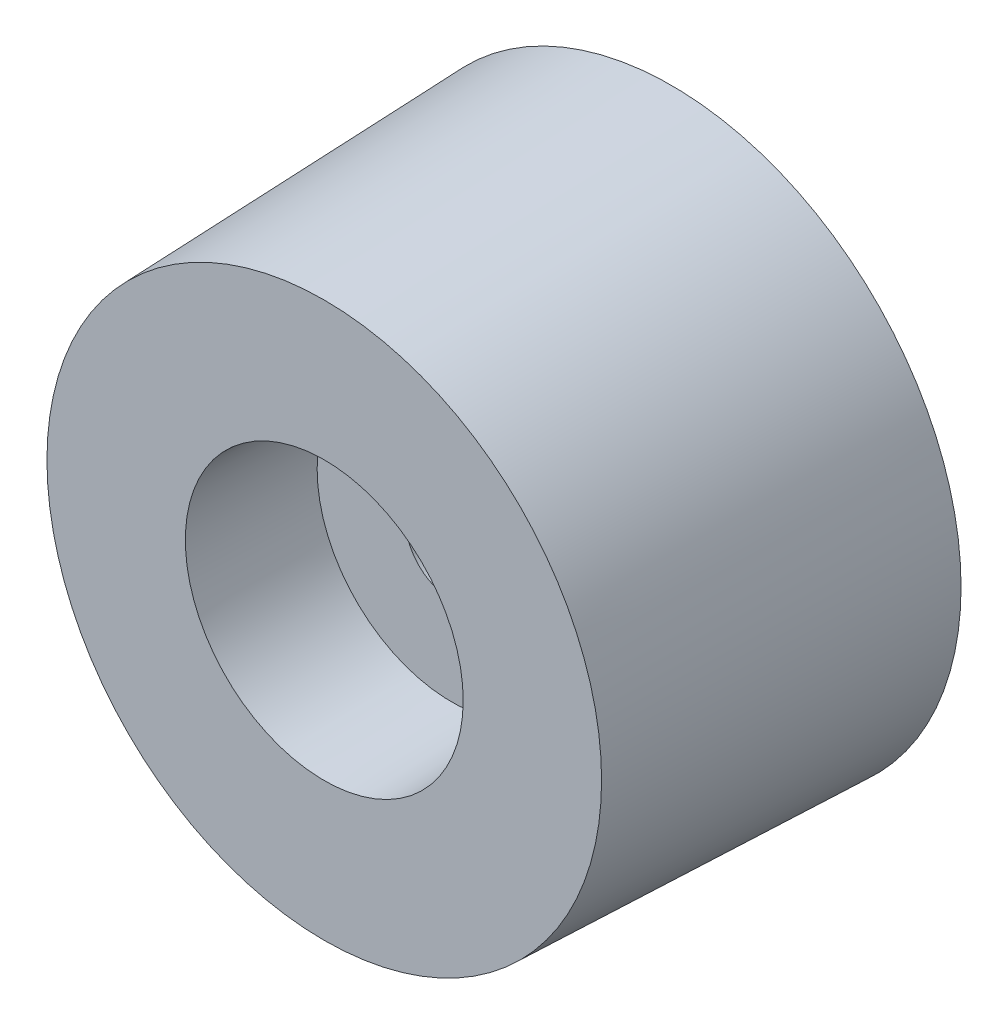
ISO-10303-21;
HEADER;
FILE_DESCRIPTION(('STEP AP214'),'2;1');
FILE_NAME('part.step','',(''),(''),'','','');
FILE_SCHEMA(('AUTOMOTIVE_DESIGN { 1 0 10303 214 1 1 1 1 }'));
ENDSEC;
DATA;
#1=APPLICATION_CONTEXT('core data for automotive mechanical design processes');
#2=APPLICATION_PROTOCOL_DEFINITION('international standard','automotive_design',2000,#1);
#3=PRODUCT_CONTEXT('',#1,'mechanical');
#4=PRODUCT('Part','Part','',(#3));
#5=PRODUCT_RELATED_PRODUCT_CATEGORY('part','',(#4));
#6=PRODUCT_DEFINITION_FORMATION('','',#4);
#7=PRODUCT_DEFINITION_CONTEXT('part definition',#1,'design');
#8=PRODUCT_DEFINITION('design','',#6,#7);
#9=PRODUCT_DEFINITION_SHAPE('','',#8);
#10=(LENGTH_UNIT() NAMED_UNIT(*) SI_UNIT(.MILLI.,.METRE.));
#11=(NAMED_UNIT(*) PLANE_ANGLE_UNIT() SI_UNIT($,.RADIAN.));
#12=(NAMED_UNIT(*) SI_UNIT($,.STERADIAN.) SOLID_ANGLE_UNIT());
#13=UNCERTAINTY_MEASURE_WITH_UNIT(LENGTH_MEASURE(1.E-05),#10,'distance_accuracy_value','');
#14=(GEOMETRIC_REPRESENTATION_CONTEXT(3) GLOBAL_UNCERTAINTY_ASSIGNED_CONTEXT((#13)) GLOBAL_UNIT_ASSIGNED_CONTEXT((#10,
#11,#12)) REPRESENTATION_CONTEXT('',''));
#15=CARTESIAN_POINT('',(0.,0.,0.));
#16=DIRECTION('',(0.,0.,1.));
#17=DIRECTION('',(1.,0.,0.));
#18=AXIS2_PLACEMENT_3D('',#15,#16,#17);
#19=CARTESIAN_POINT('',(5.55111512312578E-13,-5.58580959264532E-13,0.));
#20=DIRECTION('',(0.,0.,-0.999999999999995));
#21=DIRECTION('',(-1.,0.,0.));
#22=AXIS2_PLACEMENT_3D('',#19,#20,#21);
#23=CONICAL_SURFACE('',#22,12.5,0.0349065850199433);
#24=CARTESIAN_POINT('',(5.55111512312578E-13,-5.58580959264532E-13,15.0000000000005));
#25=DIRECTION('',(0.,0.,0.999999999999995));
#26=DIRECTION('',(1.,0.,0.));
#27=AXIS2_PLACEMENT_3D('',#24,#25,#26);
#28=CIRCLE('',#27,11.9761884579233);
#29=CARTESIAN_POINT('',(-11.9761884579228,-5.58307971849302E-13,15.0000000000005));
#30=VERTEX_POINT('',#29);
#31=EDGE_CURVE('E10',#30,#30,#28,.T.);
#32=CARTESIAN_POINT('',(5.55111512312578E-13,-5.58580959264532E-13,0.));
#33=DIRECTION('',(0.,0.,0.999999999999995));
#34=DIRECTION('',(1.,0.,0.));
#35=AXIS2_PLACEMENT_3D('',#32,#33,#34);
#36=CIRCLE('',#35,12.5);
#37=CARTESIAN_POINT('',(-12.4999999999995,-5.48866507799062E-13,0.));
#38=VERTEX_POINT('',#37);
#39=EDGE_CURVE('E42',#38,#38,#36,.T.);
#40=CARTESIAN_POINT('',(-11.9761884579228,-5.58307971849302E-13,15.0000000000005));
#41=CARTESIAN_POINT('',(-11.9816448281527,-5.58209623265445E-13,14.8437500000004));
#42=CARTESIAN_POINT('',(-11.9871011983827,-5.58111274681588E-13,14.6875000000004));
#43=CARTESIAN_POINT('',(-11.9980139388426,-5.57914577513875E-13,14.3750000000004));
#44=CARTESIAN_POINT('',(-12.0034703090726,-5.57816228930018E-13,14.2187500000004));
#45=CARTESIAN_POINT('',(-12.0143830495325,-5.57619531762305E-13,13.9062500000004));
#46=CARTESIAN_POINT('',(-12.0198394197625,-5.57521183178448E-13,13.7500000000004));
#47=CARTESIAN_POINT('',(-12.0307521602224,-5.57324486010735E-13,13.4375000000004));
#48=CARTESIAN_POINT('',(-12.0362085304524,-5.57226137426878E-13,13.2812500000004));
#49=CARTESIAN_POINT('',(-12.0471212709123,-5.57029440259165E-13,12.9687500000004));
#50=CARTESIAN_POINT('',(-12.0525776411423,-5.56931091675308E-13,12.8125000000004));
#51=CARTESIAN_POINT('',(-12.0634903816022,-5.56734394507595E-13,12.5000000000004));
#52=CARTESIAN_POINT('',(-12.0689467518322,-5.56636045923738E-13,12.3437500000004));
#53=CARTESIAN_POINT('',(-12.0798594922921,-5.56439348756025E-13,12.0312500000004));
#54=CARTESIAN_POINT('',(-12.0853158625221,-5.56341000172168E-13,11.8750000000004));
#55=CARTESIAN_POINT('',(-12.096228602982,-5.56144303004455E-13,11.5625000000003));
#56=CARTESIAN_POINT('',(-12.101684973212,-5.56045954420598E-13,11.4062500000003));
#57=CARTESIAN_POINT('',(-12.1125977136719,-5.55849257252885E-13,11.0937500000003));
#58=CARTESIAN_POINT('',(-12.1180540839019,-5.55750908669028E-13,10.9375000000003));
#59=CARTESIAN_POINT('',(-12.1289668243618,-5.55554211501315E-13,10.6250000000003));
#60=CARTESIAN_POINT('',(-12.1344231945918,-5.55455862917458E-13,10.4687500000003));
#61=CARTESIAN_POINT('',(-12.1453359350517,-5.55259165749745E-13,10.1562500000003));
#62=CARTESIAN_POINT('',(-12.1507923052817,-5.55160817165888E-13,10.0000000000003));
#63=CARTESIAN_POINT('',(-12.1617050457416,-5.54964119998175E-13,9.68750000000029));
#64=CARTESIAN_POINT('',(-12.1671614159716,-5.54865771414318E-13,9.53125000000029));
#65=CARTESIAN_POINT('',(-12.1780741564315,-5.54669074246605E-13,9.21875000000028));
#66=CARTESIAN_POINT('',(-12.1835305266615,-5.54570725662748E-13,9.06250000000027));
#67=CARTESIAN_POINT('',(-12.1944432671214,-5.54374028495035E-13,8.75000000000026));
#68=CARTESIAN_POINT('',(-12.1998996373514,-5.54275679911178E-13,8.59375000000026));
#69=CARTESIAN_POINT('',(-12.2108123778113,-5.54078982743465E-13,8.28125000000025));
#70=CARTESIAN_POINT('',(-12.2162687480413,-5.53980634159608E-13,8.12500000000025));
#71=CARTESIAN_POINT('',(-12.2271814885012,-5.53783936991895E-13,7.81250000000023));
#72=CARTESIAN_POINT('',(-12.2326378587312,-5.53685588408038E-13,7.65625000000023));
#73=CARTESIAN_POINT('',(-12.2435505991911,-5.53488891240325E-13,7.34375000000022));
#74=CARTESIAN_POINT('',(-12.2490069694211,-5.53390542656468E-13,7.18750000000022));
#75=CARTESIAN_POINT('',(-12.259919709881,-5.53193845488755E-13,6.87500000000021));
#76=CARTESIAN_POINT('',(-12.265376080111,-5.53095496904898E-13,6.7187500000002));
#77=CARTESIAN_POINT('',(-12.2762888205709,-5.52898799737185E-13,6.40625000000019));
#78=CARTESIAN_POINT('',(-12.2817451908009,-5.52800451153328E-13,6.25000000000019));
#79=CARTESIAN_POINT('',(-12.2926579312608,-5.52603753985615E-13,5.93750000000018));
#80=CARTESIAN_POINT('',(-12.2981143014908,-5.52505405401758E-13,5.78125000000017));
#81=CARTESIAN_POINT('',(-12.3090270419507,-5.52308708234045E-13,5.46875000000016));
#82=CARTESIAN_POINT('',(-12.3144834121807,-5.52210359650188E-13,5.31250000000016));
#83=CARTESIAN_POINT('',(-12.3253961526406,-5.52013662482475E-13,5.00000000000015));
#84=CARTESIAN_POINT('',(-12.3308525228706,-5.51915313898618E-13,4.84375000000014));
#85=CARTESIAN_POINT('',(-12.3417652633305,-5.51718616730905E-13,4.53125000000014));
#86=CARTESIAN_POINT('',(-12.3472216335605,-5.51620268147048E-13,4.37500000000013));
#87=CARTESIAN_POINT('',(-12.3581343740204,-5.51423570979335E-13,4.06250000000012));
#88=CARTESIAN_POINT('',(-12.3635907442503,-5.51325222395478E-13,3.90625000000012));
#89=CARTESIAN_POINT('',(-12.3745034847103,-5.51128525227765E-13,3.59375000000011));
#90=CARTESIAN_POINT('',(-12.3799598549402,-5.51030176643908E-13,3.4375000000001));
#91=CARTESIAN_POINT('',(-12.3908725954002,-5.50833479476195E-13,3.12500000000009));
#92=CARTESIAN_POINT('',(-12.3963289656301,-5.50735130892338E-13,2.96875000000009));
#93=CARTESIAN_POINT('',(-12.4072417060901,-5.50538433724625E-13,2.65625000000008));
#94=CARTESIAN_POINT('',(-12.41269807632,-5.50440085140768E-13,2.50000000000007));
#95=CARTESIAN_POINT('',(-12.42361081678,-5.50243387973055E-13,2.18750000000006));
#96=CARTESIAN_POINT('',(-12.4290671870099,-5.50145039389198E-13,2.03125000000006));
#97=CARTESIAN_POINT('',(-12.4399799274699,-5.49948342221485E-13,1.71875000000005));
#98=CARTESIAN_POINT('',(-12.4454362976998,-5.49849993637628E-13,1.56250000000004));
#99=CARTESIAN_POINT('',(-12.4563490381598,-5.49653296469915E-13,1.25000000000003));
#100=CARTESIAN_POINT('',(-12.4618054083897,-5.49554947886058E-13,1.09375000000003));
#101=CARTESIAN_POINT('',(-12.4727181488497,-5.49358250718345E-13,0.781250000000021));
#102=CARTESIAN_POINT('',(-12.4781745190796,-5.49259902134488E-13,0.625000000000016));
#103=CARTESIAN_POINT('',(-12.4890872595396,-5.49063204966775E-13,0.312500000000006));
#104=CARTESIAN_POINT('',(-12.4945436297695,-5.48964856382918E-13,0.156250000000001));
#105=CARTESIAN_POINT('',(-12.4999999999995,-5.48866507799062E-13,0.));
#106=B_SPLINE_CURVE_WITH_KNOTS('',3,(#40,#41,#42,#43,#44,#45,#46,#47,#48,#49,#50,#51,#52,#53,
#54,#55,#56,#57,#58,#59,#60,#61,#62,#63,#64,#65,#66,#67,#68,#69,#70,#71,#72,#73,#74,#75,#76,#77,
#78,#79,#80,#81,#82,#83,#84,#85,#86,#87,#88,#89,#90,#91,#92,#93,#94,#95,#96,#97,#98,#99,#100,
#101,#102,#103,#104,#105),.UNSPECIFIED.,.F.,.F.,(4,2,2,2,2,2,2,2,2,2,2,2,2,2,2,2,2,2,2,2,2,2,2,
2,2,2,2,2,2,2,2,2,4),(0.,0.46903572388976,0.938071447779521,1.40710717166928,1.87614289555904,
2.3451786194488,2.81421434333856,3.28325006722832,3.75228579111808,4.22132151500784,
4.6903572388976,5.15939296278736,5.62842868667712,6.09746441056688,6.56650013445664,
7.0355358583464,7.50457158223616,7.97360730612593,8.44264303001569,8.91167875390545,
9.38071447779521,9.84975020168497,10.3187859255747,10.7878216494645,11.2568573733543,
11.725893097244,12.1949288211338,12.6639645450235,13.1330002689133,13.6020359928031,
14.0710717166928,14.5401074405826,15.0091431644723),.UNSPECIFIED.);
#107=EDGE_CURVE('BSEAM36',#30,#38,#106,.T.);
#108=ORIENTED_EDGE('',*,*,#31,.F.);
#109=ORIENTED_EDGE('',*,*,#39,.T.);
#110=ORIENTED_EDGE('',*,*,#107,.T.);
#111=ORIENTED_EDGE('',*,*,#107,.F.);
#112=EDGE_LOOP('',(#108,#110,#109,#111));
#113=FACE_BOUND('',#112,.T.);
#114=ADVANCED_FACE('F36',(#113),#23,.T.);
#115=CARTESIAN_POINT('',(5.55111512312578E-13,-5.58580959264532E-13,15.0000000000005));
#116=DIRECTION('',(0.,0.,0.999999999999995));
#117=DIRECTION('',(1.,0.,0.));
#118=AXIS2_PLACEMENT_3D('',#115,#116,#117);
#119=PLANE('',#118);
#120=CARTESIAN_POINT('',(5.55111512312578E-13,-5.58580959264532E-13,15.0000000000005));
#121=DIRECTION('',(0.,0.,0.999999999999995));
#122=DIRECTION('',(1.,0.,0.));
#123=AXIS2_PLACEMENT_3D('',#120,#121,#122);
#124=CIRCLE('',#123,6.);
#125=CARTESIAN_POINT('',(6.00000000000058,-5.63243895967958E-13,15.0000000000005));
#126=VERTEX_POINT('',#125);
#127=EDGE_CURVE('E50',#126,#126,#124,.T.);
#128=ORIENTED_EDGE('',*,*,#127,.F.);
#129=EDGE_LOOP('',(#128));
#130=FACE_BOUND('',#129,.T.);
#131=ORIENTED_EDGE('',*,*,#31,.T.);
#132=EDGE_LOOP('',(#131));
#133=FACE_BOUND('',#132,.T.);
#134=ADVANCED_FACE('F77',(#130,#133),#119,.T.);
#135=CARTESIAN_POINT('',(5.55111512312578E-13,-5.58580959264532E-13,0.));
#136=DIRECTION('',(0.,0.,0.999999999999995));
#137=DIRECTION('',(1.,0.,0.));
#138=AXIS2_PLACEMENT_3D('',#135,#136,#137);
#139=PLANE('',#138);
#140=CARTESIAN_POINT('',(5.55111512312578E-13,-5.58580959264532E-13,0.));
#141=DIRECTION('',(0.,0.,0.999999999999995));
#142=DIRECTION('',(1.,0.,0.));
#143=AXIS2_PLACEMENT_3D('',#140,#141,#142);
#144=CIRCLE('',#143,2.);
#145=CARTESIAN_POINT('',(2.00000000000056,-5.60135271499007E-13,0.));
#146=VERTEX_POINT('',#145);
#147=EDGE_CURVE('E55',#146,#146,#144,.T.);
#148=ORIENTED_EDGE('',*,*,#147,.T.);
#149=EDGE_LOOP('',(#148));
#150=FACE_BOUND('',#149,.T.);
#151=ORIENTED_EDGE('',*,*,#39,.F.);
#152=EDGE_LOOP('',(#151));
#153=FACE_BOUND('',#152,.T.);
#154=ADVANCED_FACE('F69',(#150,#153),#139,.F.);
#155=CARTESIAN_POINT('',(5.55111512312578E-13,-5.58580959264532E-13,15.0000000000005));
#156=DIRECTION('',(0.,0.,0.999999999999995));
#157=DIRECTION('',(1.,0.,0.));
#158=AXIS2_PLACEMENT_3D('',#155,#156,#157);
#159=CONICAL_SURFACE('',#158,6.,0.0349065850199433);
#160=CARTESIAN_POINT('',(6.66133814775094E-13,0.,9.50000000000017));
#161=DIRECTION('',(0.,0.,0.999999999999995));
#162=DIRECTION('',(1.,0.,0.));
#163=AXIS2_PLACEMENT_3D('',#160,#161,#162);
#164=CIRCLE('',#163,5.80793576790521);
#165=CARTESIAN_POINT('',(5.80793576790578,-5.59782025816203E-13,9.50000000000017));
#166=VERTEX_POINT('',#165);
#167=EDGE_CURVE('E46',#166,#166,#164,.T.);
#168=CARTESIAN_POINT('',(5.80793576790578,-5.59782025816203E-13,9.50000000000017));
#169=CARTESIAN_POINT('',(5.8099364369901,-5.59818086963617E-13,9.55729166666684));
#170=CARTESIAN_POINT('',(5.81193710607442,-5.59854148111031E-13,9.61458333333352));
#171=CARTESIAN_POINT('',(5.81593844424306,-5.59926270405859E-13,9.72916666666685));
#172=CARTESIAN_POINT('',(5.81793911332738,-5.59962331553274E-13,9.78645833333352));
#173=CARTESIAN_POINT('',(5.82194045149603,-5.60034453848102E-13,9.90104166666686));
#174=CARTESIAN_POINT('',(5.82394112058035,-5.60070514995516E-13,9.95833333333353));
#175=CARTESIAN_POINT('',(5.82794245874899,-5.60142637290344E-13,10.0729166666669));
#176=CARTESIAN_POINT('',(5.82994312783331,-5.60178698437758E-13,10.1302083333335));
#177=CARTESIAN_POINT('',(5.83394446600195,-5.60250820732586E-13,10.2447916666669));
#178=CARTESIAN_POINT('',(5.83594513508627,-5.6028688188E-13,10.3020833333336));
#179=CARTESIAN_POINT('',(5.83994647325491,-5.60359004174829E-13,10.4166666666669));
#180=CARTESIAN_POINT('',(5.84194714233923,-5.60395065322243E-13,10.4739583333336));
#181=CARTESIAN_POINT('',(5.84594848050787,-5.60467187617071E-13,10.5885416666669));
#182=CARTESIAN_POINT('',(5.8479491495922,-5.60503248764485E-13,10.6458333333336));
#183=CARTESIAN_POINT('',(5.85195048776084,-5.60575371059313E-13,10.7604166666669));
#184=CARTESIAN_POINT('',(5.85395115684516,-5.60611432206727E-13,10.8177083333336));
#185=CARTESIAN_POINT('',(5.8579524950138,-5.60683554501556E-13,10.9322916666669));
#186=CARTESIAN_POINT('',(5.85995316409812,-5.6071961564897E-13,10.9895833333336));
#187=CARTESIAN_POINT('',(5.86395450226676,-5.60791737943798E-13,11.1041666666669));
#188=CARTESIAN_POINT('',(5.86595517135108,-5.60827799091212E-13,11.1614583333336));
#189=CARTESIAN_POINT('',(5.86995650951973,-5.6089992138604E-13,11.2760416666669));
#190=CARTESIAN_POINT('',(5.87195717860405,-5.60935982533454E-13,11.3333333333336));
#191=CARTESIAN_POINT('',(5.87595851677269,-5.61008104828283E-13,11.4479166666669));
#192=CARTESIAN_POINT('',(5.87795918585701,-5.61044165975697E-13,11.5052083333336));
#193=CARTESIAN_POINT('',(5.88196052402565,-5.61116288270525E-13,11.619791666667));
#194=CARTESIAN_POINT('',(5.88396119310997,-5.61152349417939E-13,11.6770833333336));
#195=CARTESIAN_POINT('',(5.88796253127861,-5.61224471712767E-13,11.791666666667));
#196=CARTESIAN_POINT('',(5.88996320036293,-5.61260532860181E-13,11.8489583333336));
#197=CARTESIAN_POINT('',(5.89396453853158,-5.6133265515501E-13,11.963541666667));
#198=CARTESIAN_POINT('',(5.8959652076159,-5.61368716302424E-13,12.0208333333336));
#199=CARTESIAN_POINT('',(5.89996654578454,-5.61440838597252E-13,12.135416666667));
#200=CARTESIAN_POINT('',(5.90196721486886,-5.61476899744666E-13,12.1927083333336));
#201=CARTESIAN_POINT('',(5.9059685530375,-5.61549022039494E-13,12.307291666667));
#202=CARTESIAN_POINT('',(5.90796922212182,-5.61585083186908E-13,12.3645833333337));
#203=CARTESIAN_POINT('',(5.91197056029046,-5.61657205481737E-13,12.479166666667));
#204=CARTESIAN_POINT('',(5.91397122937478,-5.61693266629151E-13,12.5364583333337));
#205=CARTESIAN_POINT('',(5.91797256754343,-5.61765388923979E-13,12.651041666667));
#206=CARTESIAN_POINT('',(5.91997323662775,-5.61801450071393E-13,12.7083333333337));
#207=CARTESIAN_POINT('',(5.92397457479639,-5.61873572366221E-13,12.822916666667));
#208=CARTESIAN_POINT('',(5.92597524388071,-5.61909633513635E-13,12.8802083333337));
#209=CARTESIAN_POINT('',(5.92997658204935,-5.61981755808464E-13,12.994791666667));
#210=CARTESIAN_POINT('',(5.93197725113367,-5.62017816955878E-13,13.0520833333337));
#211=CARTESIAN_POINT('',(5.93597858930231,-5.62089939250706E-13,13.166666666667));
#212=CARTESIAN_POINT('',(5.93797925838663,-5.6212600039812E-13,13.2239583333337));
#213=CARTESIAN_POINT('',(5.94198059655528,-5.62198122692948E-13,13.338541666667));
#214=CARTESIAN_POINT('',(5.9439812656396,-5.62234183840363E-13,13.3958333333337));
#215=CARTESIAN_POINT('',(5.94798260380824,-5.62306306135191E-13,13.510416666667));
#216=CARTESIAN_POINT('',(5.94998327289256,-5.62342367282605E-13,13.5677083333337));
#217=CARTESIAN_POINT('',(5.9539846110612,-5.62414489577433E-13,13.6822916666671));
#218=CARTESIAN_POINT('',(5.95598528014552,-5.62450550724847E-13,13.7395833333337));
#219=CARTESIAN_POINT('',(5.95998661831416,-5.62522673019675E-13,13.8541666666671));
#220=CARTESIAN_POINT('',(5.96198728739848,-5.62558734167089E-13,13.9114583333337));
#221=CARTESIAN_POINT('',(5.96598862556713,-5.62630856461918E-13,14.0260416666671));
#222=CARTESIAN_POINT('',(5.96798929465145,-5.62666917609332E-13,14.0833333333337));
#223=CARTESIAN_POINT('',(5.97199063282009,-5.6273903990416E-13,14.1979166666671));
#224=CARTESIAN_POINT('',(5.97399130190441,-5.62775101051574E-13,14.2552083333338));
#225=CARTESIAN_POINT('',(5.97799264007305,-5.62847223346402E-13,14.3697916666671));
#226=CARTESIAN_POINT('',(5.97999330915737,-5.62883284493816E-13,14.4270833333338));
#227=CARTESIAN_POINT('',(5.98399464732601,-5.62955406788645E-13,14.5416666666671));
#228=CARTESIAN_POINT('',(5.98599531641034,-5.62991467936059E-13,14.5989583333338));
#229=CARTESIAN_POINT('',(5.98999665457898,-5.63063590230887E-13,14.7135416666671));
#230=CARTESIAN_POINT('',(5.9919973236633,-5.63099651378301E-13,14.7708333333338));
#231=CARTESIAN_POINT('',(5.99599866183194,-5.63171773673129E-13,14.8854166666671));
#232=CARTESIAN_POINT('',(5.99799933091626,-5.63207834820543E-13,14.9427083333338));
#233=CARTESIAN_POINT('',(6.00000000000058,-5.63243895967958E-13,15.0000000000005));
#234=B_SPLINE_CURVE_WITH_KNOTS('',3,(#168,#169,#170,#171,#172,#173,#174,#175,#176,#177,#178,
#179,#180,#181,#182,#183,#184,#185,#186,#187,#188,#189,#190,#191,#192,#193,#194,#195,#196,#197,
#198,#199,#200,#201,#202,#203,#204,#205,#206,#207,#208,#209,#210,#211,#212,#213,#214,#215,#216,
#217,#218,#219,#220,#221,#222,#223,#224,#225,#226,#227,#228,#229,#230,#231,#232,#233),
.UNSPECIFIED.,.F.,.F.,(4,2,2,2,2,2,2,2,2,2,2,2,2,2,2,2,2,2,2,2,2,2,2,2,2,2,2,2,2,2,2,2,4),(0.,
0.171979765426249,0.343959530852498,0.515939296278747,0.687919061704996,0.859898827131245,
1.03187859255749,1.20385835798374,1.37583812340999,1.54781788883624,1.71979765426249,
1.89177741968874,2.06375718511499,2.23573695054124,2.40771671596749,2.57969648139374,
2.75167624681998,2.92365601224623,3.09563577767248,3.26761554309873,3.43959530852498,
3.61157507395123,3.78355483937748,3.95553460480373,4.12751437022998,4.29949413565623,
4.47147390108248,4.64345366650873,4.81543343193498,4.98741319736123,5.15939296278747,
5.33137272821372,5.50335249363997),.UNSPECIFIED.);
#235=EDGE_CURVE('BSEAM67',#166,#126,#234,.T.);
#236=ORIENTED_EDGE('',*,*,#167,.F.);
#237=ORIENTED_EDGE('',*,*,#127,.T.);
#238=ORIENTED_EDGE('',*,*,#235,.T.);
#239=ORIENTED_EDGE('',*,*,#235,.F.);
#240=EDGE_LOOP('',(#236,#238,#237,#239));
#241=FACE_BOUND('',#240,.T.);
#242=ADVANCED_FACE('F67',(#241),#159,.F.);
#243=CARTESIAN_POINT('',(6.66133814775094E-13,0.,9.50000000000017));
#244=DIRECTION('',(0.,0.,0.999999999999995));
#245=DIRECTION('',(1.,0.,0.));
#246=AXIS2_PLACEMENT_3D('',#243,#244,#245);
#247=PLANE('',#246);
#248=CARTESIAN_POINT('',(6.66133814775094E-13,0.,9.50000000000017));
#249=DIRECTION('',(0.,0.,0.999999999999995));
#250=DIRECTION('',(1.,0.,0.));
#251=AXIS2_PLACEMENT_3D('',#248,#249,#250);
#252=CIRCLE('',#251,2.);
#253=CARTESIAN_POINT('',(2.00000000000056,-5.65857045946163E-13,9.50000000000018));
#254=VERTEX_POINT('',#253);
#255=EDGE_CURVE('E58',#254,#254,#252,.T.);
#256=ORIENTED_EDGE('',*,*,#255,.F.);
#257=EDGE_LOOP('',(#256));
#258=FACE_BOUND('',#257,.T.);
#259=ORIENTED_EDGE('',*,*,#167,.T.);
#260=EDGE_LOOP('',(#259));
#261=FACE_BOUND('',#260,.T.);
#262=ADVANCED_FACE('F64',(#258,#261),#247,.T.);
#263=CARTESIAN_POINT('',(5.55111512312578E-13,-5.58580959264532E-13,0.));
#264=DIRECTION('',(0.,0.,0.999999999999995));
#265=DIRECTION('',(1.,0.,0.));
#266=AXIS2_PLACEMENT_3D('',#263,#264,#265);
#267=CYLINDRICAL_SURFACE('',#266,2.);
#268=CARTESIAN_POINT('',(2.00000000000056,-5.60135271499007E-13,0.));
#269=CARTESIAN_POINT('',(2.00000000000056,-5.60194873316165E-13,0.0989583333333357));
#270=CARTESIAN_POINT('',(2.00000000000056,-5.60254475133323E-13,0.197916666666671));
#271=CARTESIAN_POINT('',(2.00000000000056,-5.60373678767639E-13,0.395833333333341));
#272=CARTESIAN_POINT('',(2.00000000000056,-5.60433280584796E-13,0.494791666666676));
#273=CARTESIAN_POINT('',(2.00000000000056,-5.60552484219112E-13,0.692708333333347));
#274=CARTESIAN_POINT('',(2.00000000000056,-5.6061208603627E-13,0.791666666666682));
#275=CARTESIAN_POINT('',(2.00000000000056,-5.60731289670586E-13,0.989583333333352));
#276=CARTESIAN_POINT('',(2.00000000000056,-5.60790891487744E-13,1.08854166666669));
#277=CARTESIAN_POINT('',(2.00000000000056,-5.60910095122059E-13,1.28645833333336));
#278=CARTESIAN_POINT('',(2.00000000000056,-5.60969696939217E-13,1.38541666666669));
#279=CARTESIAN_POINT('',(2.00000000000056,-5.61088900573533E-13,1.58333333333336));
#280=CARTESIAN_POINT('',(2.00000000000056,-5.61148502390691E-13,1.6822916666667));
#281=CARTESIAN_POINT('',(2.00000000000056,-5.61267706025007E-13,1.88020833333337));
#282=CARTESIAN_POINT('',(2.00000000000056,-5.61327307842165E-13,1.9791666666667));
#283=CARTESIAN_POINT('',(2.00000000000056,-5.6144651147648E-13,2.17708333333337));
#284=CARTESIAN_POINT('',(2.00000000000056,-5.61506113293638E-13,2.27604166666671));
#285=CARTESIAN_POINT('',(2.00000000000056,-5.61625316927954E-13,2.47395833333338));
#286=CARTESIAN_POINT('',(2.00000000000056,-5.61684918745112E-13,2.57291666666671));
#287=CARTESIAN_POINT('',(2.00000000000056,-5.61804122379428E-13,2.77083333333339));
#288=CARTESIAN_POINT('',(2.00000000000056,-5.61863724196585E-13,2.86979166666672));
#289=CARTESIAN_POINT('',(2.00000000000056,-5.61982927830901E-13,3.06770833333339));
#290=CARTESIAN_POINT('',(2.00000000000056,-5.62042529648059E-13,3.16666666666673));
#291=CARTESIAN_POINT('',(2.00000000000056,-5.62161733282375E-13,3.3645833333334));
#292=CARTESIAN_POINT('',(2.00000000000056,-5.62221335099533E-13,3.46354166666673));
#293=CARTESIAN_POINT('',(2.00000000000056,-5.62340538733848E-13,3.6614583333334));
#294=CARTESIAN_POINT('',(2.00000000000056,-5.62400140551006E-13,3.76041666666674));
#295=CARTESIAN_POINT('',(2.00000000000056,-5.62519344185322E-13,3.95833333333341));
#296=CARTESIAN_POINT('',(2.00000000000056,-5.6257894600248E-13,4.05729166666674));
#297=CARTESIAN_POINT('',(2.00000000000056,-5.62698149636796E-13,4.25520833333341));
#298=CARTESIAN_POINT('',(2.00000000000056,-5.62757751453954E-13,4.35416666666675));
#299=CARTESIAN_POINT('',(2.00000000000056,-5.62876955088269E-13,4.55208333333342));
#300=CARTESIAN_POINT('',(2.00000000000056,-5.62936556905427E-13,4.65104166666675));
#301=CARTESIAN_POINT('',(2.00000000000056,-5.63055760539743E-13,4.84895833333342));
#302=CARTESIAN_POINT('',(2.00000000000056,-5.63115362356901E-13,4.94791666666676));
#303=CARTESIAN_POINT('',(2.00000000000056,-5.63234565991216E-13,5.14583333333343));
#304=CARTESIAN_POINT('',(2.00000000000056,-5.63294167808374E-13,5.24479166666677));
#305=CARTESIAN_POINT('',(2.00000000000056,-5.6341337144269E-13,5.44270833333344));
#306=CARTESIAN_POINT('',(2.00000000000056,-5.63472973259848E-13,5.54166666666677));
#307=CARTESIAN_POINT('',(2.00000000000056,-5.63592176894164E-13,5.73958333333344));
#308=CARTESIAN_POINT('',(2.00000000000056,-5.63651778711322E-13,5.83854166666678));
#309=CARTESIAN_POINT('',(2.00000000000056,-5.63770982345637E-13,6.03645833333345));
#310=CARTESIAN_POINT('',(2.00000000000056,-5.63830584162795E-13,6.13541666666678));
#311=CARTESIAN_POINT('',(2.00000000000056,-5.63949787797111E-13,6.33333333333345));
#312=CARTESIAN_POINT('',(2.00000000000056,-5.64009389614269E-13,6.43229166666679));
#313=CARTESIAN_POINT('',(2.00000000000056,-5.64128593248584E-13,6.63020833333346));
#314=CARTESIAN_POINT('',(2.00000000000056,-5.64188195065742E-13,6.72916666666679));
#315=CARTESIAN_POINT('',(2.00000000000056,-5.64307398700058E-13,6.92708333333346));
#316=CARTESIAN_POINT('',(2.00000000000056,-5.64367000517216E-13,7.0260416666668));
#317=CARTESIAN_POINT('',(2.00000000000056,-5.64486204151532E-13,7.22395833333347));
#318=CARTESIAN_POINT('',(2.00000000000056,-5.6454580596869E-13,7.3229166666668));
#319=CARTESIAN_POINT('',(2.00000000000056,-5.64665009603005E-13,7.52083333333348));
#320=CARTESIAN_POINT('',(2.00000000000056,-5.64724611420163E-13,7.61979166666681));
#321=CARTESIAN_POINT('',(2.00000000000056,-5.64843815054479E-13,7.81770833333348));
#322=CARTESIAN_POINT('',(2.00000000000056,-5.64903416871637E-13,7.91666666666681));
#323=CARTESIAN_POINT('',(2.00000000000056,-5.65022620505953E-13,8.11458333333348));
#324=CARTESIAN_POINT('',(2.00000000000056,-5.6508222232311E-13,8.21354166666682));
#325=CARTESIAN_POINT('',(2.00000000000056,-5.65201425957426E-13,8.41145833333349));
#326=CARTESIAN_POINT('',(2.00000000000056,-5.65261027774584E-13,8.51041666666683));
#327=CARTESIAN_POINT('',(2.00000000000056,-5.653802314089E-13,8.7083333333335));
#328=CARTESIAN_POINT('',(2.00000000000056,-5.65439833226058E-13,8.80729166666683));
#329=CARTESIAN_POINT('',(2.00000000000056,-5.65559036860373E-13,9.0052083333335));
#330=CARTESIAN_POINT('',(2.00000000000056,-5.65618638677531E-13,9.10416666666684));
#331=CARTESIAN_POINT('',(2.00000000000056,-5.65737842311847E-13,9.30208333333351));
#332=CARTESIAN_POINT('',(2.00000000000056,-5.65797444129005E-13,9.40104166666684));
#333=CARTESIAN_POINT('',(2.00000000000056,-5.65857045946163E-13,9.50000000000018));
#334=B_SPLINE_CURVE_WITH_KNOTS('',3,(#268,#269,#270,#271,#272,#273,#274,#275,#276,#277,#278,
#279,#280,#281,#282,#283,#284,#285,#286,#287,#288,#289,#290,#291,#292,#293,#294,#295,#296,#297,
#298,#299,#300,#301,#302,#303,#304,#305,#306,#307,#308,#309,#310,#311,#312,#313,#314,#315,#316,
#317,#318,#319,#320,#321,#322,#323,#324,#325,#326,#327,#328,#329,#330,#331,#332,#333),
.UNSPECIFIED.,.F.,.F.,(4,2,2,2,2,2,2,2,2,2,2,2,2,2,2,2,2,2,2,2,2,2,2,2,2,2,2,2,2,2,2,2,4),(0.,
0.296875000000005,0.593750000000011,0.890625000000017,1.18750000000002,1.48437500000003,
1.78125000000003,2.07812500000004,2.37500000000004,2.67187500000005,2.96875000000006,
3.26562500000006,3.56250000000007,3.85937500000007,4.15625000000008,4.45312500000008,
4.75000000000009,5.0468750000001,5.3437500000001,5.64062500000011,5.93750000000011,
6.23437500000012,6.53125000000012,6.82812500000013,7.12500000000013,7.42187500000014,
7.71875000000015,8.01562500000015,8.31250000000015,8.60937500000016,8.90625000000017,
9.20312500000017,9.50000000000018),.UNSPECIFIED.);
#335=EDGE_CURVE('BSEAM62',#146,#254,#334,.T.);
#336=ORIENTED_EDGE('',*,*,#147,.F.);
#337=ORIENTED_EDGE('',*,*,#255,.T.);
#338=ORIENTED_EDGE('',*,*,#335,.T.);
#339=ORIENTED_EDGE('',*,*,#335,.F.);
#340=EDGE_LOOP('',(#336,#338,#337,#339));
#341=FACE_BOUND('',#340,.T.);
#342=ADVANCED_FACE('F62',(#341),#267,.F.);
#343=CLOSED_SHELL('',(#114,#134,#154,#242,#262,#342));
#344=MANIFOLD_SOLID_BREP('B2',#343);
#345=ADVANCED_BREP_SHAPE_REPRESENTATION('',(#18,#344),#14);
#346=SHAPE_DEFINITION_REPRESENTATION(#9,#345);
ENDSEC;
END-ISO-10303-21;
